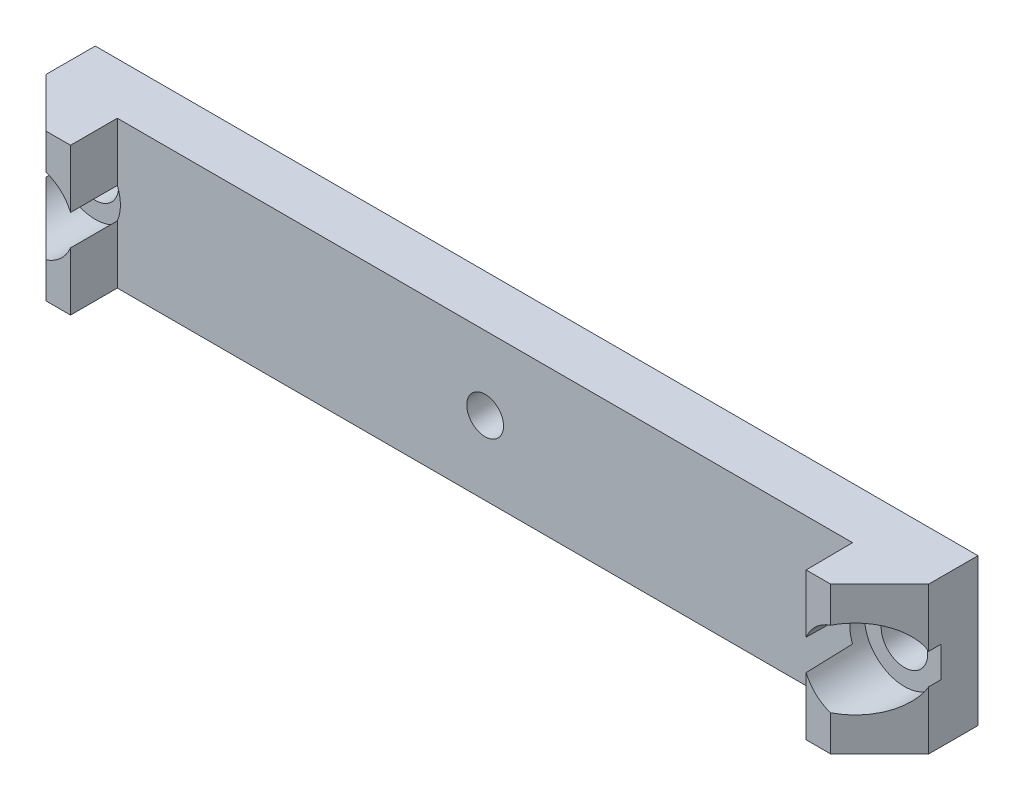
ISO-10303-21;
HEADER;
FILE_DESCRIPTION(('STEP AP214'),'2;1');
FILE_NAME('part.step','',(''),(''),'','','');
FILE_SCHEMA(('AUTOMOTIVE_DESIGN { 1 0 10303 214 1 1 1 1 }'));
ENDSEC;
DATA;
#1=APPLICATION_CONTEXT('core data for automotive mechanical design processes');
#2=APPLICATION_PROTOCOL_DEFINITION('international standard','automotive_design',2000,#1);
#3=PRODUCT_CONTEXT('',#1,'mechanical');
#4=PRODUCT('Part','Part','',(#3));
#5=PRODUCT_RELATED_PRODUCT_CATEGORY('part','',(#4));
#6=PRODUCT_DEFINITION_FORMATION('','',#4);
#7=PRODUCT_DEFINITION_CONTEXT('part definition',#1,'design');
#8=PRODUCT_DEFINITION('design','',#6,#7);
#9=PRODUCT_DEFINITION_SHAPE('','',#8);
#10=(LENGTH_UNIT() NAMED_UNIT(*) SI_UNIT(.MILLI.,.METRE.));
#11=(NAMED_UNIT(*) PLANE_ANGLE_UNIT() SI_UNIT($,.RADIAN.));
#12=(NAMED_UNIT(*) SI_UNIT($,.STERADIAN.) SOLID_ANGLE_UNIT());
#13=UNCERTAINTY_MEASURE_WITH_UNIT(LENGTH_MEASURE(1.E-05),#10,'distance_accuracy_value','');
#14=(GEOMETRIC_REPRESENTATION_CONTEXT(3) GLOBAL_UNCERTAINTY_ASSIGNED_CONTEXT((#13)) GLOBAL_UNIT_ASSIGNED_CONTEXT((#10,
#11,#12)) REPRESENTATION_CONTEXT('',''));
#15=CARTESIAN_POINT('',(0.,0.,0.));
#16=DIRECTION('',(0.,0.,1.));
#17=DIRECTION('',(1.,0.,0.));
#18=AXIS2_PLACEMENT_3D('',#15,#16,#17);
#19=CARTESIAN_POINT('',(-33.,0.,-9.19238815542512));
#20=DIRECTION('',(0.,0.,1.));
#21=DIRECTION('',(1.,0.,0.));
#22=AXIS2_PLACEMENT_3D('',#19,#20,#21);
#23=CYLINDRICAL_SURFACE('',#22,3.25);
#24=CARTESIAN_POINT('',(-33.,0.,3.));
#25=DIRECTION('',(0.,0.,1.));
#26=DIRECTION('',(1.,0.,0.));
#27=AXIS2_PLACEMENT_3D('',#24,#25,#26);
#28=CIRCLE('',#27,3.25);
#29=CARTESIAN_POINT('',(-36.,-1.24999999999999,3.));
#30=VERTEX_POINT('',#29);
#31=CARTESIAN_POINT('',(-36.,1.24999999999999,3.));
#32=VERTEX_POINT('',#31);
#33=EDGE_CURVE('E198',#30,#32,#28,.T.);
#34=ORIENTED_EDGE('',*,*,#33,.F.);
#35=DIRECTION('',(0.,0.,1.));
#36=VECTOR('',#35,1.);
#37=CARTESIAN_POINT('',(-36.,-1.24999999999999,-9.19238815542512));
#38=LINE('',#37,#36);
#39=CARTESIAN_POINT('',(-36.,-1.24999999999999,4.01789608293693));
#40=VERTEX_POINT('',#39);
#41=EDGE_CURVE('E219',#40,#30,#38,.F.);
#42=ORIENTED_EDGE('',*,*,#41,.F.);
#43=CARTESIAN_POINT('',(-33.,0.,7.01789608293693));
#44=DIRECTION('',(-0.707106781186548,0.,0.707106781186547));
#45=DIRECTION('',(0.707106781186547,0.,0.707106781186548));
#46=AXIS2_PLACEMENT_3D('',#43,#44,#45);
#47=ELLIPSE('',#46,4.59619407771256,3.25);
#48=CARTESIAN_POINT('',(-32.,-3.09232921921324,8.01789608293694));
#49=VERTEX_POINT('',#48);
#50=EDGE_CURVE('E177',#49,#40,#47,.F.);
#51=ORIENTED_EDGE('',*,*,#50,.F.);
#52=CARTESIAN_POINT('',(-33.,0.,8.01789608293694));
#53=DIRECTION('',(0.,0.,1.));
#54=DIRECTION('',(1.,0.,0.));
#55=AXIS2_PLACEMENT_3D('',#52,#53,#54);
#56=CIRCLE('',#55,3.25);
#57=CARTESIAN_POINT('',(-30.,-1.25,8.01789608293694));
#58=VERTEX_POINT('',#57);
#59=EDGE_CURVE('E195',#58,#49,#56,.F.);
#60=ORIENTED_EDGE('',*,*,#59,.F.);
#61=DIRECTION('',(0.,0.,-1.));
#62=VECTOR('',#61,1.);
#63=CARTESIAN_POINT('',(-30.,-1.25,4.2));
#64=LINE('',#63,#62);
#65=CARTESIAN_POINT('',(-30.,-1.25,4.2));
#66=VERTEX_POINT('',#65);
#67=EDGE_CURVE('E197',#66,#58,#64,.F.);
#68=ORIENTED_EDGE('',*,*,#67,.F.);
#69=CARTESIAN_POINT('',(-33.,0.,4.2));
#70=DIRECTION('',(0.,0.,1.));
#71=DIRECTION('',(1.,0.,0.));
#72=AXIS2_PLACEMENT_3D('',#69,#70,#71);
#73=CIRCLE('',#72,3.25);
#74=CARTESIAN_POINT('',(-30.,1.25,4.2));
#75=VERTEX_POINT('',#74);
#76=EDGE_CURVE('E192',#75,#66,#73,.F.);
#77=ORIENTED_EDGE('',*,*,#76,.F.);
#78=DIRECTION('',(0.,0.,-1.));
#79=VECTOR('',#78,1.);
#80=CARTESIAN_POINT('',(-30.,1.25,4.2));
#81=LINE('',#80,#79);
#82=CARTESIAN_POINT('',(-30.,1.25,8.01789608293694));
#83=VERTEX_POINT('',#82);
#84=EDGE_CURVE('E205',#83,#75,#81,.T.);
#85=ORIENTED_EDGE('',*,*,#84,.F.);
#86=CARTESIAN_POINT('',(-33.,0.,8.01789608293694));
#87=DIRECTION('',(0.,0.,1.));
#88=DIRECTION('',(1.,0.,0.));
#89=AXIS2_PLACEMENT_3D('',#86,#87,#88);
#90=CIRCLE('',#89,3.25);
#91=CARTESIAN_POINT('',(-32.,3.09232921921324,8.01789608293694));
#92=VERTEX_POINT('',#91);
#93=EDGE_CURVE('E204',#92,#83,#90,.F.);
#94=ORIENTED_EDGE('',*,*,#93,.F.);
#95=CARTESIAN_POINT('',(-33.,0.,7.01789608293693));
#96=DIRECTION('',(-0.707106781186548,0.,0.707106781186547));
#97=DIRECTION('',(0.707106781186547,0.,0.707106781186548));
#98=AXIS2_PLACEMENT_3D('',#95,#96,#97);
#99=ELLIPSE('',#98,4.59619407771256,3.25);
#100=CARTESIAN_POINT('',(-36.,1.24999999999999,4.01789608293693));
#101=VERTEX_POINT('',#100);
#102=EDGE_CURVE('E202',#101,#92,#99,.F.);
#103=ORIENTED_EDGE('',*,*,#102,.F.);
#104=DIRECTION('',(0.,0.,1.));
#105=VECTOR('',#104,1.);
#106=CARTESIAN_POINT('',(-36.,1.24999999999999,-9.19238815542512));
#107=LINE('',#106,#105);
#108=EDGE_CURVE('E222',#32,#101,#107,.T.);
#109=ORIENTED_EDGE('',*,*,#108,.F.);
#110=EDGE_LOOP('',(#34,#42,#51,#60,#68,#77,#85,#94,#103,#109));
#111=FACE_BOUND('',#110,.T.);
#112=ADVANCED_FACE('F16',(#111),#23,.F.);
#113=CARTESIAN_POINT('',(33.,0.,-9.19238815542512));
#114=DIRECTION('',(0.,0.,1.));
#115=DIRECTION('',(1.,0.,0.));
#116=AXIS2_PLACEMENT_3D('',#113,#114,#115);
#117=CYLINDRICAL_SURFACE('',#116,3.25);
#118=CARTESIAN_POINT('',(33.,0.,4.2));
#119=DIRECTION('',(0.,0.,1.));
#120=DIRECTION('',(1.,0.,0.));
#121=AXIS2_PLACEMENT_3D('',#118,#119,#120);
#122=CIRCLE('',#121,3.25);
#123=CARTESIAN_POINT('',(29.9636318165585,-1.15886507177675,4.2));
#124=VERTEX_POINT('',#123);
#125=CARTESIAN_POINT('',(29.9636318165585,1.15886507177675,4.2));
#126=VERTEX_POINT('',#125);
#127=EDGE_CURVE('E188',#124,#126,#122,.F.);
#128=ORIENTED_EDGE('',*,*,#127,.F.);
#129=CARTESIAN_POINT('',(30.,-1.25000000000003,8.01789608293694));
#130=CARTESIAN_POINT('',(29.9811279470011,-1.20470707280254,6.03672654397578));
#131=CARTESIAN_POINT('',(29.9636318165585,-1.15886507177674,4.2));
#132=B_SPLINE_CURVE_WITH_KNOTS('',2,(#129,#130,#131),.UNSPECIFIED.,.F.,.F.,(3,3),(0.,1.),.UNSPECIFIED.);
#133=CARTESIAN_POINT('',(30.,-1.25000000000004,8.01789608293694));
#134=VERTEX_POINT('',#133);
#135=EDGE_CURVE('E309',#134,#124,#132,.T.);
#136=ORIENTED_EDGE('',*,*,#135,.F.);
#137=CARTESIAN_POINT('',(33.,0.,8.01789608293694));
#138=DIRECTION('',(0.,0.,1.));
#139=DIRECTION('',(1.,0.,0.));
#140=AXIS2_PLACEMENT_3D('',#137,#138,#139);
#141=CIRCLE('',#140,3.25);
#142=CARTESIAN_POINT('',(32.,-3.09232921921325,8.01789608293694));
#143=VERTEX_POINT('',#142);
#144=EDGE_CURVE('E185',#143,#134,#141,.F.);
#145=ORIENTED_EDGE('',*,*,#144,.F.);
#146=CARTESIAN_POINT('',(33.,0.,7.01789608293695));
#147=DIRECTION('',(0.707106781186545,0.,0.70710678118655));
#148=DIRECTION('',(-0.70710678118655,0.,0.707106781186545));
#149=AXIS2_PLACEMENT_3D('',#146,#147,#148);
#150=ELLIPSE('',#149,4.59619407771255,3.25);
#151=CARTESIAN_POINT('',(36.,-1.24999999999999,4.01789608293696));
#152=VERTEX_POINT('',#151);
#153=EDGE_CURVE('E168',#152,#143,#150,.F.);
#154=ORIENTED_EDGE('',*,*,#153,.F.);
#155=DIRECTION('',(0.,0.,1.));
#156=VECTOR('',#155,1.);
#157=CARTESIAN_POINT('',(36.,-1.24999999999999,-9.19238815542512));
#158=LINE('',#157,#156);
#159=CARTESIAN_POINT('',(36.,-1.24999999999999,3.));
#160=VERTEX_POINT('',#159);
#161=EDGE_CURVE('E159',#160,#152,#158,.T.);
#162=ORIENTED_EDGE('',*,*,#161,.F.);
#163=CARTESIAN_POINT('',(33.,0.,3.));
#164=DIRECTION('',(0.,0.,1.));
#165=DIRECTION('',(1.,0.,0.));
#166=AXIS2_PLACEMENT_3D('',#163,#164,#165);
#167=CIRCLE('',#166,3.25);
#168=CARTESIAN_POINT('',(36.,1.24999999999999,3.));
#169=VERTEX_POINT('',#168);
#170=EDGE_CURVE('E243',#169,#160,#167,.T.);
#171=ORIENTED_EDGE('',*,*,#170,.F.);
#172=DIRECTION('',(0.,0.,1.));
#173=VECTOR('',#172,1.);
#174=CARTESIAN_POINT('',(36.,1.24999999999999,-9.19238815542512));
#175=LINE('',#174,#173);
#176=CARTESIAN_POINT('',(36.,1.24999999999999,4.01789608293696));
#177=VERTEX_POINT('',#176);
#178=EDGE_CURVE('E173',#177,#169,#175,.F.);
#179=ORIENTED_EDGE('',*,*,#178,.F.);
#180=CARTESIAN_POINT('',(33.,0.,7.01789608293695));
#181=DIRECTION('',(0.707106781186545,0.,0.70710678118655));
#182=DIRECTION('',(-0.70710678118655,0.,0.707106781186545));
#183=AXIS2_PLACEMENT_3D('',#180,#181,#182);
#184=ELLIPSE('',#183,4.59619407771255,3.25);
#185=CARTESIAN_POINT('',(32.,3.09232921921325,8.01789608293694));
#186=VERTEX_POINT('',#185);
#187=EDGE_CURVE('E165',#186,#177,#184,.F.);
#188=ORIENTED_EDGE('',*,*,#187,.F.);
#189=CARTESIAN_POINT('',(33.,0.,8.01789608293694));
#190=DIRECTION('',(0.,0.,1.));
#191=DIRECTION('',(1.,0.,0.));
#192=AXIS2_PLACEMENT_3D('',#189,#190,#191);
#193=CIRCLE('',#192,3.25);
#194=CARTESIAN_POINT('',(30.,1.25000000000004,8.01789608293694));
#195=VERTEX_POINT('',#194);
#196=EDGE_CURVE('E19',#195,#186,#193,.F.);
#197=ORIENTED_EDGE('',*,*,#196,.F.);
#198=CARTESIAN_POINT('',(29.9636318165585,1.15886507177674,4.2));
#199=CARTESIAN_POINT('',(29.9811279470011,1.20470707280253,6.03672654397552));
#200=CARTESIAN_POINT('',(30.,1.25000000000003,8.01789608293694));
#201=B_SPLINE_CURVE_WITH_KNOTS('',2,(#198,#199,#200),.UNSPECIFIED.,.F.,.F.,(3,3),(0.,1.),.UNSPECIFIED.);
#202=EDGE_CURVE('E158',#126,#195,#201,.T.);
#203=ORIENTED_EDGE('',*,*,#202,.F.);
#204=EDGE_LOOP('',(#128,#136,#145,#154,#162,#171,#179,#188,#197,#203));
#205=FACE_BOUND('',#204,.T.);
#206=ADVANCED_FACE('F171',(#205),#117,.F.);
#207=CARTESIAN_POINT('',(30.,12.9891874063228,8.01789608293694));
#208=DIRECTION('',(0.,0.,1.));
#209=DIRECTION('',(1.,0.,0.));
#210=AXIS2_PLACEMENT_3D('',#207,#208,#209);
#211=PLANE('',#210);
#212=DIRECTION('',(1.,0.,0.));
#213=VECTOR('',#212,1.);
#214=CARTESIAN_POINT('',(-36.,6.,8.01789608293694));
#215=LINE('',#214,#213);
#216=CARTESIAN_POINT('',(32.,6.,8.01789608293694));
#217=VERTEX_POINT('',#216);
#218=CARTESIAN_POINT('',(30.,6.,8.01789608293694));
#219=VERTEX_POINT('',#218);
#220=EDGE_CURVE('E291',#217,#219,#215,.F.);
#221=ORIENTED_EDGE('',*,*,#220,.T.);
#222=DIRECTION('',(0.,1.,0.));
#223=VECTOR('',#222,1.);
#224=CARTESIAN_POINT('',(30.,12.9891874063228,8.01789608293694));
#225=LINE('',#224,#223);
#226=EDGE_CURVE('E154',#195,#219,#225,.T.);
#227=ORIENTED_EDGE('',*,*,#226,.F.);
#228=ORIENTED_EDGE('',*,*,#196,.T.);
#229=DIRECTION('',(0.,1.,0.));
#230=VECTOR('',#229,1.);
#231=CARTESIAN_POINT('',(32.,12.9891874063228,8.01789608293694));
#232=LINE('',#231,#230);
#233=EDGE_CURVE('E152',#217,#186,#232,.F.);
#234=ORIENTED_EDGE('',*,*,#233,.F.);
#235=EDGE_LOOP('',(#221,#227,#228,#234));
#236=FACE_BOUND('',#235,.T.);
#237=ADVANCED_FACE('F151',(#236),#211,.T.);
#238=CARTESIAN_POINT('',(29.9636318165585,12.9891874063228,4.2));
#239=DIRECTION('',(-0.999954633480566,0.,0.00952528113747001));
#240=DIRECTION('',(0.00952528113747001,0.,0.999954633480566));
#241=AXIS2_PLACEMENT_3D('',#238,#239,#240);
#242=PLANE('',#241);
#243=DIRECTION('',(-0.00952528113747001,0.,-0.999954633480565));
#244=VECTOR('',#243,1.);
#245=CARTESIAN_POINT('',(30.,6.,8.01789608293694));
#246=LINE('',#245,#244);
#247=CARTESIAN_POINT('',(29.9636318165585,6.,4.2));
#248=VERTEX_POINT('',#247);
#249=EDGE_CURVE('E373',#219,#248,#246,.T.);
#250=ORIENTED_EDGE('',*,*,#249,.T.);
#251=DIRECTION('',(0.,1.,0.));
#252=VECTOR('',#251,1.);
#253=CARTESIAN_POINT('',(29.9636318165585,0.,4.2));
#254=LINE('',#253,#252);
#255=EDGE_CURVE('E190',#126,#248,#254,.T.);
#256=ORIENTED_EDGE('',*,*,#255,.F.);
#257=ORIENTED_EDGE('',*,*,#202,.T.);
#258=ORIENTED_EDGE('',*,*,#226,.T.);
#259=EDGE_LOOP('',(#250,#256,#257,#258));
#260=FACE_BOUND('',#259,.T.);
#261=ADVANCED_FACE('F354',(#260),#242,.T.);
#262=CARTESIAN_POINT('',(-30.,12.9891874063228,4.2));
#263=DIRECTION('',(1.,0.,0.));
#264=DIRECTION('',(0.,0.,-1.));
#265=AXIS2_PLACEMENT_3D('',#262,#263,#264);
#266=PLANE('',#265);
#267=DIRECTION('',(0.,0.,-1.));
#268=VECTOR('',#267,1.);
#269=CARTESIAN_POINT('',(-30.,6.,4.2));
#270=LINE('',#269,#268);
#271=CARTESIAN_POINT('',(-30.,6.,4.2));
#272=VERTEX_POINT('',#271);
#273=CARTESIAN_POINT('',(-30.,6.,8.01789608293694));
#274=VERTEX_POINT('',#273);
#275=EDGE_CURVE('E431',#272,#274,#270,.F.);
#276=ORIENTED_EDGE('',*,*,#275,.T.);
#277=DIRECTION('',(0.,1.,0.));
#278=VECTOR('',#277,1.);
#279=CARTESIAN_POINT('',(-30.,12.9891874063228,8.01789608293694));
#280=LINE('',#279,#278);
#281=EDGE_CURVE('E203',#83,#274,#280,.T.);
#282=ORIENTED_EDGE('',*,*,#281,.F.);
#283=ORIENTED_EDGE('',*,*,#84,.T.);
#284=DIRECTION('',(0.,1.,0.));
#285=VECTOR('',#284,1.);
#286=CARTESIAN_POINT('',(-30.,0.,4.2));
#287=LINE('',#286,#285);
#288=EDGE_CURVE('E313',#272,#75,#287,.F.);
#289=ORIENTED_EDGE('',*,*,#288,.F.);
#290=EDGE_LOOP('',(#276,#282,#283,#289));
#291=FACE_BOUND('',#290,.T.);
#292=ADVANCED_FACE('F351',(#291),#266,.T.);
#293=CARTESIAN_POINT('',(-30.,12.9891874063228,8.01789608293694));
#294=DIRECTION('',(0.,0.,1.));
#295=DIRECTION('',(1.,0.,0.));
#296=AXIS2_PLACEMENT_3D('',#293,#294,#295);
#297=PLANE('',#296);
#298=DIRECTION('',(1.,0.,0.));
#299=VECTOR('',#298,1.);
#300=CARTESIAN_POINT('',(-36.,6.,8.01789608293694));
#301=LINE('',#300,#299);
#302=CARTESIAN_POINT('',(-32.,6.,8.01789608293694));
#303=VERTEX_POINT('',#302);
#304=EDGE_CURVE('E412',#274,#303,#301,.F.);
#305=ORIENTED_EDGE('',*,*,#304,.T.);
#306=DIRECTION('',(0.,1.,0.));
#307=VECTOR('',#306,1.);
#308=CARTESIAN_POINT('',(-32.,12.9891874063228,8.01789608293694));
#309=LINE('',#308,#307);
#310=EDGE_CURVE('E201',#92,#303,#309,.T.);
#311=ORIENTED_EDGE('',*,*,#310,.F.);
#312=ORIENTED_EDGE('',*,*,#93,.T.);
#313=ORIENTED_EDGE('',*,*,#281,.T.);
#314=EDGE_LOOP('',(#305,#311,#312,#313));
#315=FACE_BOUND('',#314,.T.);
#316=ADVANCED_FACE('F347',(#315),#297,.T.);
#317=CARTESIAN_POINT('',(-32.,12.9891874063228,8.01789608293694));
#318=DIRECTION('',(-0.707106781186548,0.,0.707106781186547));
#319=DIRECTION('',(0.707106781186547,0.,0.707106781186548));
#320=AXIS2_PLACEMENT_3D('',#317,#318,#319);
#321=PLANE('',#320);
#322=DIRECTION('',(-0.707106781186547,0.,-0.707106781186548));
#323=VECTOR('',#322,1.);
#324=CARTESIAN_POINT('',(-32.,6.,8.01789608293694));
#325=LINE('',#324,#323);
#326=CARTESIAN_POINT('',(-36.,6.,4.01789608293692));
#327=VERTEX_POINT('',#326);
#328=EDGE_CURVE('E410',#303,#327,#325,.T.);
#329=ORIENTED_EDGE('',*,*,#328,.T.);
#330=DIRECTION('',(0.,1.,0.));
#331=VECTOR('',#330,1.);
#332=CARTESIAN_POINT('',(-36.,6.,4.01789608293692));
#333=LINE('',#332,#331);
#334=EDGE_CURVE('E389',#327,#101,#333,.F.);
#335=ORIENTED_EDGE('',*,*,#334,.T.);
#336=ORIENTED_EDGE('',*,*,#102,.T.);
#337=ORIENTED_EDGE('',*,*,#310,.T.);
#338=EDGE_LOOP('',(#329,#335,#336,#337));
#339=FACE_BOUND('',#338,.T.);
#340=ADVANCED_FACE('F343',(#339),#321,.T.);
#341=CARTESIAN_POINT('',(0.,0.,3.));
#342=DIRECTION('',(0.,0.,1.));
#343=DIRECTION('',(1.,0.,0.));
#344=AXIS2_PLACEMENT_3D('',#341,#342,#343);
#345=PLANE('',#344);
#346=DIRECTION('',(0.,1.,0.));
#347=VECTOR('',#346,1.);
#348=CARTESIAN_POINT('',(-36.,6.,3.));
#349=LINE('',#348,#347);
#350=EDGE_CURVE('E382',#32,#30,#349,.F.);
#351=ORIENTED_EDGE('',*,*,#350,.T.);
#352=ORIENTED_EDGE('',*,*,#33,.T.);
#353=EDGE_LOOP('',(#351,#352));
#354=FACE_BOUND('',#353,.T.);
#355=CARTESIAN_POINT('',(-33.,0.,3.));
#356=DIRECTION('',(0.,0.,1.));
#357=DIRECTION('',(1.,0.,0.));
#358=AXIS2_PLACEMENT_3D('',#355,#356,#357);
#359=CIRCLE('',#358,1.9);
#360=CARTESIAN_POINT('',(-31.1,0.,3.));
#361=VERTEX_POINT('',#360);
#362=EDGE_CURVE('E238',#361,#361,#359,.F.);
#363=ORIENTED_EDGE('',*,*,#362,.T.);
#364=EDGE_LOOP('',(#363));
#365=FACE_BOUND('',#364,.T.);
#366=ADVANCED_FACE('F339',(#354,#365),#345,.T.);
#367=CARTESIAN_POINT('',(-30.,12.9891874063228,8.01789608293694));
#368=DIRECTION('',(0.,0.,1.));
#369=DIRECTION('',(1.,0.,0.));
#370=AXIS2_PLACEMENT_3D('',#367,#368,#369);
#371=PLANE('',#370);
#372=DIRECTION('',(1.,0.,0.));
#373=VECTOR('',#372,1.);
#374=CARTESIAN_POINT('',(-36.,-6.,8.01789608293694));
#375=LINE('',#374,#373);
#376=CARTESIAN_POINT('',(-32.,-6.,8.01789608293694));
#377=VERTEX_POINT('',#376);
#378=CARTESIAN_POINT('',(-30.,-6.,8.01789608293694));
#379=VERTEX_POINT('',#378);
#380=EDGE_CURVE('E388',#377,#379,#375,.T.);
#381=ORIENTED_EDGE('',*,*,#380,.T.);
#382=DIRECTION('',(0.,1.,0.));
#383=VECTOR('',#382,1.);
#384=CARTESIAN_POINT('',(-30.,12.9891874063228,8.01789608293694));
#385=LINE('',#384,#383);
#386=EDGE_CURVE('E194',#58,#379,#385,.F.);
#387=ORIENTED_EDGE('',*,*,#386,.F.);
#388=ORIENTED_EDGE('',*,*,#59,.T.);
#389=DIRECTION('',(0.,1.,0.));
#390=VECTOR('',#389,1.);
#391=CARTESIAN_POINT('',(-32.,12.9891874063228,8.01789608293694));
#392=LINE('',#391,#390);
#393=EDGE_CURVE('E174',#377,#49,#392,.T.);
#394=ORIENTED_EDGE('',*,*,#393,.F.);
#395=EDGE_LOOP('',(#381,#387,#388,#394));
#396=FACE_BOUND('',#395,.T.);
#397=ADVANCED_FACE('F335',(#396),#371,.T.);
#398=CARTESIAN_POINT('',(-30.,12.9891874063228,4.2));
#399=DIRECTION('',(1.,0.,0.));
#400=DIRECTION('',(0.,0.,-1.));
#401=AXIS2_PLACEMENT_3D('',#398,#399,#400);
#402=PLANE('',#401);
#403=DIRECTION('',(0.,0.,1.));
#404=VECTOR('',#403,1.);
#405=CARTESIAN_POINT('',(-30.,-6.,4.2));
#406=LINE('',#405,#404);
#407=CARTESIAN_POINT('',(-30.,-6.,4.2));
#408=VERTEX_POINT('',#407);
#409=EDGE_CURVE('E392',#379,#408,#406,.F.);
#410=ORIENTED_EDGE('',*,*,#409,.T.);
#411=DIRECTION('',(0.,1.,0.));
#412=VECTOR('',#411,1.);
#413=CARTESIAN_POINT('',(-30.,0.,4.2));
#414=LINE('',#413,#412);
#415=EDGE_CURVE('E191',#66,#408,#414,.F.);
#416=ORIENTED_EDGE('',*,*,#415,.F.);
#417=ORIENTED_EDGE('',*,*,#67,.T.);
#418=ORIENTED_EDGE('',*,*,#386,.T.);
#419=EDGE_LOOP('',(#410,#416,#417,#418));
#420=FACE_BOUND('',#419,.T.);
#421=ADVANCED_FACE('F331',(#420),#402,.T.);
#422=CARTESIAN_POINT('',(0.,0.,4.2));
#423=DIRECTION('',(0.,0.,1.));
#424=DIRECTION('',(1.,0.,0.));
#425=AXIS2_PLACEMENT_3D('',#422,#423,#424);
#426=PLANE('',#425);
#427=ORIENTED_EDGE('',*,*,#288,.T.);
#428=ORIENTED_EDGE('',*,*,#76,.T.);
#429=ORIENTED_EDGE('',*,*,#415,.T.);
#430=DIRECTION('',(1.,0.,0.));
#431=VECTOR('',#430,1.);
#432=CARTESIAN_POINT('',(-36.,-6.,4.2));
#433=LINE('',#432,#431);
#434=CARTESIAN_POINT('',(29.9636318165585,-6.,4.2));
#435=VERTEX_POINT('',#434);
#436=EDGE_CURVE('E306',#408,#435,#433,.T.);
#437=ORIENTED_EDGE('',*,*,#436,.T.);
#438=DIRECTION('',(0.,1.,0.));
#439=VECTOR('',#438,1.);
#440=CARTESIAN_POINT('',(29.9636318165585,12.9891874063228,4.2));
#441=LINE('',#440,#439);
#442=EDGE_CURVE('E187',#124,#435,#441,.F.);
#443=ORIENTED_EDGE('',*,*,#442,.F.);
#444=ORIENTED_EDGE('',*,*,#127,.T.);
#445=ORIENTED_EDGE('',*,*,#255,.T.);
#446=DIRECTION('',(1.,0.,0.));
#447=VECTOR('',#446,1.);
#448=CARTESIAN_POINT('',(-36.,6.,4.2));
#449=LINE('',#448,#447);
#450=EDGE_CURVE('E438',#248,#272,#449,.F.);
#451=ORIENTED_EDGE('',*,*,#450,.T.);
#452=EDGE_LOOP('',(#427,#428,#429,#437,#443,#444,#445,#451));
#453=FACE_BOUND('',#452,.T.);
#454=CARTESIAN_POINT('',(0.,0.,4.2));
#455=DIRECTION('',(0.,0.,1.));
#456=DIRECTION('',(1.,0.,0.));
#457=AXIS2_PLACEMENT_3D('',#454,#455,#456);
#458=CIRCLE('',#457,1.5);
#459=CARTESIAN_POINT('',(1.5,0.,4.2));
#460=VERTEX_POINT('',#459);
#461=EDGE_CURVE('E241',#460,#460,#458,.F.);
#462=ORIENTED_EDGE('',*,*,#461,.T.);
#463=EDGE_LOOP('',(#462));
#464=FACE_BOUND('',#463,.T.);
#465=ADVANCED_FACE('F326',(#453,#464),#426,.T.);
#466=CARTESIAN_POINT('',(29.9636318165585,12.9891874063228,4.2));
#467=DIRECTION('',(-0.999954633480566,0.,0.00952528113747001));
#468=DIRECTION('',(0.00952528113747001,0.,0.999954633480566));
#469=AXIS2_PLACEMENT_3D('',#466,#467,#468);
#470=PLANE('',#469);
#471=DIRECTION('',(0.00952528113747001,0.,0.999954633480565));
#472=VECTOR('',#471,1.);
#473=CARTESIAN_POINT('',(29.9636318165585,-6.,4.2));
#474=LINE('',#473,#472);
#475=CARTESIAN_POINT('',(30.,-6.,8.01789608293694));
#476=VERTEX_POINT('',#475);
#477=EDGE_CURVE('E298',#435,#476,#474,.T.);
#478=ORIENTED_EDGE('',*,*,#477,.T.);
#479=DIRECTION('',(0.,1.,0.));
#480=VECTOR('',#479,1.);
#481=CARTESIAN_POINT('',(30.,12.9891874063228,8.01789608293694));
#482=LINE('',#481,#480);
#483=EDGE_CURVE('E184',#134,#476,#482,.F.);
#484=ORIENTED_EDGE('',*,*,#483,.F.);
#485=ORIENTED_EDGE('',*,*,#135,.T.);
#486=ORIENTED_EDGE('',*,*,#442,.T.);
#487=EDGE_LOOP('',(#478,#484,#485,#486));
#488=FACE_BOUND('',#487,.T.);
#489=ADVANCED_FACE('F315',(#488),#470,.T.);
#490=CARTESIAN_POINT('',(30.,12.9891874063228,8.01789608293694));
#491=DIRECTION('',(0.,0.,1.));
#492=DIRECTION('',(1.,0.,0.));
#493=AXIS2_PLACEMENT_3D('',#490,#491,#492);
#494=PLANE('',#493);
#495=DIRECTION('',(1.,0.,0.));
#496=VECTOR('',#495,1.);
#497=CARTESIAN_POINT('',(-36.,-6.,8.01789608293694));
#498=LINE('',#497,#496);
#499=CARTESIAN_POINT('',(32.,-6.,8.01789608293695));
#500=VERTEX_POINT('',#499);
#501=EDGE_CURVE('E269',#476,#500,#498,.T.);
#502=ORIENTED_EDGE('',*,*,#501,.T.);
#503=DIRECTION('',(0.,1.,0.));
#504=VECTOR('',#503,1.);
#505=CARTESIAN_POINT('',(32.,12.9891874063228,8.01789608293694));
#506=LINE('',#505,#504);
#507=EDGE_CURVE('E245',#143,#500,#506,.F.);
#508=ORIENTED_EDGE('',*,*,#507,.F.);
#509=ORIENTED_EDGE('',*,*,#144,.T.);
#510=ORIENTED_EDGE('',*,*,#483,.T.);
#511=EDGE_LOOP('',(#502,#508,#509,#510));
#512=FACE_BOUND('',#511,.T.);
#513=ADVANCED_FACE('F325',(#512),#494,.T.);
#514=CARTESIAN_POINT('',(-32.,12.9891874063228,8.01789608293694));
#515=DIRECTION('',(-0.707106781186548,0.,0.707106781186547));
#516=DIRECTION('',(0.707106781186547,0.,0.707106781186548));
#517=AXIS2_PLACEMENT_3D('',#514,#515,#516);
#518=PLANE('',#517);
#519=DIRECTION('',(0.707106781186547,0.,0.707106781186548));
#520=VECTOR('',#519,1.);
#521=CARTESIAN_POINT('',(-36.,-6.,4.01789608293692));
#522=LINE('',#521,#520);
#523=CARTESIAN_POINT('',(-36.,-6.,4.01789608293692));
#524=VERTEX_POINT('',#523);
#525=EDGE_CURVE('E283',#524,#377,#522,.T.);
#526=ORIENTED_EDGE('',*,*,#525,.T.);
#527=ORIENTED_EDGE('',*,*,#393,.T.);
#528=ORIENTED_EDGE('',*,*,#50,.T.);
#529=DIRECTION('',(0.,1.,0.));
#530=VECTOR('',#529,1.);
#531=CARTESIAN_POINT('',(-36.,6.,4.01789608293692));
#532=LINE('',#531,#530);
#533=EDGE_CURVE('E384',#40,#524,#532,.F.);
#534=ORIENTED_EDGE('',*,*,#533,.T.);
#535=EDGE_LOOP('',(#526,#527,#528,#534));
#536=FACE_BOUND('',#535,.T.);
#537=ADVANCED_FACE('F476',(#536),#518,.T.);
#538=CARTESIAN_POINT('',(32.,12.9891874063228,8.01789608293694));
#539=DIRECTION('',(0.707106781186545,0.,0.70710678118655));
#540=DIRECTION('',(0.70710678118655,0.,-0.707106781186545));
#541=AXIS2_PLACEMENT_3D('',#538,#539,#540);
#542=PLANE('',#541);
#543=DIRECTION('',(-0.707106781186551,0.,0.707106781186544));
#544=VECTOR('',#543,1.);
#545=CARTESIAN_POINT('',(36.,6.,4.01789608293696));
#546=LINE('',#545,#544);
#547=CARTESIAN_POINT('',(36.,6.,4.01789608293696));
#548=VERTEX_POINT('',#547);
#549=EDGE_CURVE('E167',#548,#217,#546,.T.);
#550=ORIENTED_EDGE('',*,*,#549,.T.);
#551=ORIENTED_EDGE('',*,*,#233,.T.);
#552=ORIENTED_EDGE('',*,*,#187,.T.);
#553=DIRECTION('',(0.,1.,0.));
#554=VECTOR('',#553,1.);
#555=CARTESIAN_POINT('',(36.,6.,4.01789608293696));
#556=LINE('',#555,#554);
#557=EDGE_CURVE('E281',#177,#548,#556,.T.);
#558=ORIENTED_EDGE('',*,*,#557,.T.);
#559=EDGE_LOOP('',(#550,#551,#552,#558));
#560=FACE_BOUND('',#559,.T.);
#561=ADVANCED_FACE('F163',(#560),#542,.T.);
#562=CARTESIAN_POINT('',(32.,12.9891874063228,8.01789608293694));
#563=DIRECTION('',(0.707106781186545,0.,0.70710678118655));
#564=DIRECTION('',(0.70710678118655,0.,-0.707106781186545));
#565=AXIS2_PLACEMENT_3D('',#562,#563,#564);
#566=PLANE('',#565);
#567=DIRECTION('',(0.707106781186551,0.,-0.707106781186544));
#568=VECTOR('',#567,1.);
#569=CARTESIAN_POINT('',(32.,-6.,8.01789608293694));
#570=LINE('',#569,#568);
#571=CARTESIAN_POINT('',(36.,-6.,4.01789608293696));
#572=VERTEX_POINT('',#571);
#573=EDGE_CURVE('E266',#500,#572,#570,.T.);
#574=ORIENTED_EDGE('',*,*,#573,.T.);
#575=DIRECTION('',(0.,1.,0.));
#576=VECTOR('',#575,1.);
#577=CARTESIAN_POINT('',(36.,6.,4.01789608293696));
#578=LINE('',#577,#576);
#579=EDGE_CURVE('E257',#572,#152,#578,.T.);
#580=ORIENTED_EDGE('',*,*,#579,.T.);
#581=ORIENTED_EDGE('',*,*,#153,.T.);
#582=ORIENTED_EDGE('',*,*,#507,.T.);
#583=EDGE_LOOP('',(#574,#580,#581,#582));
#584=FACE_BOUND('',#583,.T.);
#585=ADVANCED_FACE('F541',(#584),#566,.T.);
#586=CARTESIAN_POINT('',(0.,0.,3.));
#587=DIRECTION('',(0.,0.,1.));
#588=DIRECTION('',(1.,0.,0.));
#589=AXIS2_PLACEMENT_3D('',#586,#587,#588);
#590=PLANE('',#589);
#591=DIRECTION('',(0.,1.,0.));
#592=VECTOR('',#591,1.);
#593=CARTESIAN_POINT('',(36.,6.,3.));
#594=LINE('',#593,#592);
#595=EDGE_CURVE('E234',#160,#169,#594,.T.);
#596=ORIENTED_EDGE('',*,*,#595,.T.);
#597=ORIENTED_EDGE('',*,*,#170,.T.);
#598=EDGE_LOOP('',(#596,#597));
#599=FACE_BOUND('',#598,.T.);
#600=CARTESIAN_POINT('',(33.,0.,3.));
#601=DIRECTION('',(0.,0.,1.));
#602=DIRECTION('',(1.,0.,0.));
#603=AXIS2_PLACEMENT_3D('',#600,#601,#602);
#604=CIRCLE('',#603,1.9);
#605=CARTESIAN_POINT('',(34.9,0.,3.));
#606=VERTEX_POINT('',#605);
#607=EDGE_CURVE('E235',#606,#606,#604,.F.);
#608=ORIENTED_EDGE('',*,*,#607,.T.);
#609=EDGE_LOOP('',(#608));
#610=FACE_BOUND('',#609,.T.);
#611=ADVANCED_FACE('F537',(#599,#610),#590,.T.);
#612=CARTESIAN_POINT('',(0.,0.,0.));
#613=DIRECTION('',(0.,0.,1.));
#614=DIRECTION('',(1.,0.,0.));
#615=AXIS2_PLACEMENT_3D('',#612,#613,#614);
#616=CYLINDRICAL_SURFACE('',#615,1.5);
#617=CARTESIAN_POINT('',(0.,0.,0.));
#618=DIRECTION('',(0.,0.,1.));
#619=DIRECTION('',(1.,0.,0.));
#620=AXIS2_PLACEMENT_3D('',#617,#618,#619);
#621=CIRCLE('',#620,1.5);
#622=CARTESIAN_POINT('',(1.5,0.,0.));
#623=VERTEX_POINT('',#622);
#624=EDGE_CURVE('E231',#623,#623,#621,.F.);
#625=ORIENTED_EDGE('',*,*,#624,.T.);
#626=EDGE_LOOP('',(#625));
#627=FACE_BOUND('',#626,.T.);
#628=ORIENTED_EDGE('',*,*,#461,.F.);
#629=EDGE_LOOP('',(#628));
#630=FACE_BOUND('',#629,.T.);
#631=ADVANCED_FACE('F533',(#627,#630),#616,.F.);
#632=CARTESIAN_POINT('',(-33.,0.,0.));
#633=DIRECTION('',(0.,0.,1.));
#634=DIRECTION('',(1.,0.,0.));
#635=AXIS2_PLACEMENT_3D('',#632,#633,#634);
#636=CYLINDRICAL_SURFACE('',#635,1.9);
#637=CARTESIAN_POINT('',(-33.,0.,0.));
#638=DIRECTION('',(0.,0.,1.));
#639=DIRECTION('',(1.,0.,0.));
#640=AXIS2_PLACEMENT_3D('',#637,#638,#639);
#641=CIRCLE('',#640,1.9);
#642=CARTESIAN_POINT('',(-31.1,0.,0.));
#643=VERTEX_POINT('',#642);
#644=EDGE_CURVE('E228',#643,#643,#641,.F.);
#645=ORIENTED_EDGE('',*,*,#644,.T.);
#646=EDGE_LOOP('',(#645));
#647=FACE_BOUND('',#646,.T.);
#648=ORIENTED_EDGE('',*,*,#362,.F.);
#649=EDGE_LOOP('',(#648));
#650=FACE_BOUND('',#649,.T.);
#651=ADVANCED_FACE('F529',(#647,#650),#636,.F.);
#652=CARTESIAN_POINT('',(33.,0.,0.));
#653=DIRECTION('',(0.,0.,1.));
#654=DIRECTION('',(1.,0.,0.));
#655=AXIS2_PLACEMENT_3D('',#652,#653,#654);
#656=CYLINDRICAL_SURFACE('',#655,1.9);
#657=CARTESIAN_POINT('',(33.,0.,0.));
#658=DIRECTION('',(0.,0.,1.));
#659=DIRECTION('',(1.,0.,0.));
#660=AXIS2_PLACEMENT_3D('',#657,#658,#659);
#661=CIRCLE('',#660,1.9);
#662=CARTESIAN_POINT('',(34.9,0.,0.));
#663=VERTEX_POINT('',#662);
#664=EDGE_CURVE('E224',#663,#663,#661,.F.);
#665=ORIENTED_EDGE('',*,*,#664,.T.);
#666=EDGE_LOOP('',(#665));
#667=FACE_BOUND('',#666,.T.);
#668=ORIENTED_EDGE('',*,*,#607,.F.);
#669=EDGE_LOOP('',(#668));
#670=FACE_BOUND('',#669,.T.);
#671=ADVANCED_FACE('F526',(#667,#670),#656,.F.);
#672=CARTESIAN_POINT('',(-36.,6.,4.2));
#673=DIRECTION('',(0.,-1.,0.));
#674=DIRECTION('',(0.,0.,-1.));
#675=AXIS2_PLACEMENT_3D('',#672,#673,#674);
#676=PLANE('',#675);
#677=ORIENTED_EDGE('',*,*,#328,.F.);
#678=ORIENTED_EDGE('',*,*,#304,.F.);
#679=ORIENTED_EDGE('',*,*,#275,.F.);
#680=ORIENTED_EDGE('',*,*,#450,.F.);
#681=ORIENTED_EDGE('',*,*,#249,.F.);
#682=ORIENTED_EDGE('',*,*,#220,.F.);
#683=ORIENTED_EDGE('',*,*,#549,.F.);
#684=DIRECTION('',(0.,0.,1.));
#685=VECTOR('',#684,1.);
#686=CARTESIAN_POINT('',(36.,6.,4.2));
#687=LINE('',#686,#685);
#688=CARTESIAN_POINT('',(36.,6.,0.));
#689=VERTEX_POINT('',#688);
#690=EDGE_CURVE('E263',#548,#689,#687,.F.);
#691=ORIENTED_EDGE('',*,*,#690,.T.);
#692=DIRECTION('',(1.,0.,0.));
#693=VECTOR('',#692,1.);
#694=CARTESIAN_POINT('',(0.,6.,0.));
#695=LINE('',#694,#693);
#696=CARTESIAN_POINT('',(-36.,6.,0.));
#697=VERTEX_POINT('',#696);
#698=EDGE_CURVE('E227',#689,#697,#695,.F.);
#699=ORIENTED_EDGE('',*,*,#698,.T.);
#700=DIRECTION('',(0.,0.,-1.));
#701=VECTOR('',#700,1.);
#702=CARTESIAN_POINT('',(-36.,6.,4.2));
#703=LINE('',#702,#701);
#704=EDGE_CURVE('E395',#697,#327,#703,.F.);
#705=ORIENTED_EDGE('',*,*,#704,.T.);
#706=EDGE_LOOP('',(#677,#678,#679,#680,#681,#682,#683,#691,#699,#705));
#707=FACE_BOUND('',#706,.T.);
#708=ADVANCED_FACE('F450',(#707),#676,.F.);
#709=CARTESIAN_POINT('',(-36.,6.,4.2));
#710=DIRECTION('',(1.,0.,0.));
#711=DIRECTION('',(0.,0.,-1.));
#712=AXIS2_PLACEMENT_3D('',#709,#710,#711);
#713=PLANE('',#712);
#714=ORIENTED_EDGE('',*,*,#108,.T.);
#715=ORIENTED_EDGE('',*,*,#334,.F.);
#716=ORIENTED_EDGE('',*,*,#704,.F.);
#717=DIRECTION('',(0.,1.,0.));
#718=VECTOR('',#717,1.);
#719=CARTESIAN_POINT('',(-36.,0.,0.));
#720=LINE('',#719,#718);
#721=CARTESIAN_POINT('',(-36.,-6.,0.));
#722=VERTEX_POINT('',#721);
#723=EDGE_CURVE('E276',#697,#722,#720,.F.);
#724=ORIENTED_EDGE('',*,*,#723,.T.);
#725=DIRECTION('',(0.,0.,1.));
#726=VECTOR('',#725,1.);
#727=CARTESIAN_POINT('',(-36.,-6.,4.2));
#728=LINE('',#727,#726);
#729=EDGE_CURVE('E268',#722,#524,#728,.T.);
#730=ORIENTED_EDGE('',*,*,#729,.T.);
#731=ORIENTED_EDGE('',*,*,#533,.F.);
#732=ORIENTED_EDGE('',*,*,#41,.T.);
#733=ORIENTED_EDGE('',*,*,#350,.F.);
#734=EDGE_LOOP('',(#714,#715,#716,#724,#730,#731,#732,#733));
#735=FACE_BOUND('',#734,.T.);
#736=ADVANCED_FACE('F381',(#735),#713,.F.);
#737=CARTESIAN_POINT('',(-36.,-6.,4.2));
#738=DIRECTION('',(0.,1.,0.));
#739=DIRECTION('',(0.,0.,1.));
#740=AXIS2_PLACEMENT_3D('',#737,#738,#739);
#741=PLANE('',#740);
#742=ORIENTED_EDGE('',*,*,#729,.F.);
#743=DIRECTION('',(1.,0.,0.));
#744=VECTOR('',#743,1.);
#745=CARTESIAN_POINT('',(0.,-6.,0.));
#746=LINE('',#745,#744);
#747=CARTESIAN_POINT('',(36.,-6.,0.));
#748=VERTEX_POINT('',#747);
#749=EDGE_CURVE('E25',#722,#748,#746,.T.);
#750=ORIENTED_EDGE('',*,*,#749,.T.);
#751=DIRECTION('',(0.,0.,1.));
#752=VECTOR('',#751,1.);
#753=CARTESIAN_POINT('',(36.,-6.,4.2));
#754=LINE('',#753,#752);
#755=EDGE_CURVE('E33',#748,#572,#754,.T.);
#756=ORIENTED_EDGE('',*,*,#755,.T.);
#757=ORIENTED_EDGE('',*,*,#573,.F.);
#758=ORIENTED_EDGE('',*,*,#501,.F.);
#759=ORIENTED_EDGE('',*,*,#477,.F.);
#760=ORIENTED_EDGE('',*,*,#436,.F.);
#761=ORIENTED_EDGE('',*,*,#409,.F.);
#762=ORIENTED_EDGE('',*,*,#380,.F.);
#763=ORIENTED_EDGE('',*,*,#525,.F.);
#764=EDGE_LOOP('',(#742,#750,#756,#757,#758,#759,#760,#761,#762,#763));
#765=FACE_BOUND('',#764,.T.);
#766=ADVANCED_FACE('F479',(#765),#741,.F.);
#767=CARTESIAN_POINT('',(36.,6.,4.2));
#768=DIRECTION('',(-1.,0.,0.));
#769=DIRECTION('',(0.,0.,1.));
#770=AXIS2_PLACEMENT_3D('',#767,#768,#769);
#771=PLANE('',#770);
#772=ORIENTED_EDGE('',*,*,#161,.T.);
#773=ORIENTED_EDGE('',*,*,#579,.F.);
#774=ORIENTED_EDGE('',*,*,#755,.F.);
#775=DIRECTION('',(0.,1.,0.));
#776=VECTOR('',#775,1.);
#777=CARTESIAN_POINT('',(36.,0.,0.));
#778=LINE('',#777,#776);
#779=EDGE_CURVE('E11',#748,#689,#778,.T.);
#780=ORIENTED_EDGE('',*,*,#779,.T.);
#781=ORIENTED_EDGE('',*,*,#690,.F.);
#782=ORIENTED_EDGE('',*,*,#557,.F.);
#783=ORIENTED_EDGE('',*,*,#178,.T.);
#784=ORIENTED_EDGE('',*,*,#595,.F.);
#785=EDGE_LOOP('',(#772,#773,#774,#780,#781,#782,#783,#784));
#786=FACE_BOUND('',#785,.T.);
#787=ADVANCED_FACE('F489',(#786),#771,.F.);
#788=CARTESIAN_POINT('',(0.,0.,0.));
#789=DIRECTION('',(0.,0.,1.));
#790=DIRECTION('',(1.,0.,0.));
#791=AXIS2_PLACEMENT_3D('',#788,#789,#790);
#792=PLANE('',#791);
#793=ORIENTED_EDGE('',*,*,#749,.F.);
#794=ORIENTED_EDGE('',*,*,#723,.F.);
#795=ORIENTED_EDGE('',*,*,#698,.F.);
#796=ORIENTED_EDGE('',*,*,#779,.F.);
#797=EDGE_LOOP('',(#793,#794,#795,#796));
#798=FACE_BOUND('',#797,.T.);
#799=ORIENTED_EDGE('',*,*,#664,.F.);
#800=EDGE_LOOP('',(#799));
#801=FACE_BOUND('',#800,.T.);
#802=ORIENTED_EDGE('',*,*,#644,.F.);
#803=EDGE_LOOP('',(#802));
#804=FACE_BOUND('',#803,.T.);
#805=ORIENTED_EDGE('',*,*,#624,.F.);
#806=EDGE_LOOP('',(#805));
#807=FACE_BOUND('',#806,.T.);
#808=ADVANCED_FACE('F486',(#798,#801,#804,#807),#792,.F.);
#809=CLOSED_SHELL('',(#112,#206,#237,#261,#292,#316,#340,#366,#397,#421,#465,#489,#513,#537,
#561,#585,#611,#631,#651,#671,#708,#736,#766,#787,#808));
#810=MANIFOLD_SOLID_BREP('B1',#809);
#811=ADVANCED_BREP_SHAPE_REPRESENTATION('',(#18,#810),#14);
#812=SHAPE_DEFINITION_REPRESENTATION(#9,#811);
ENDSEC;
END-ISO-10303-21;
